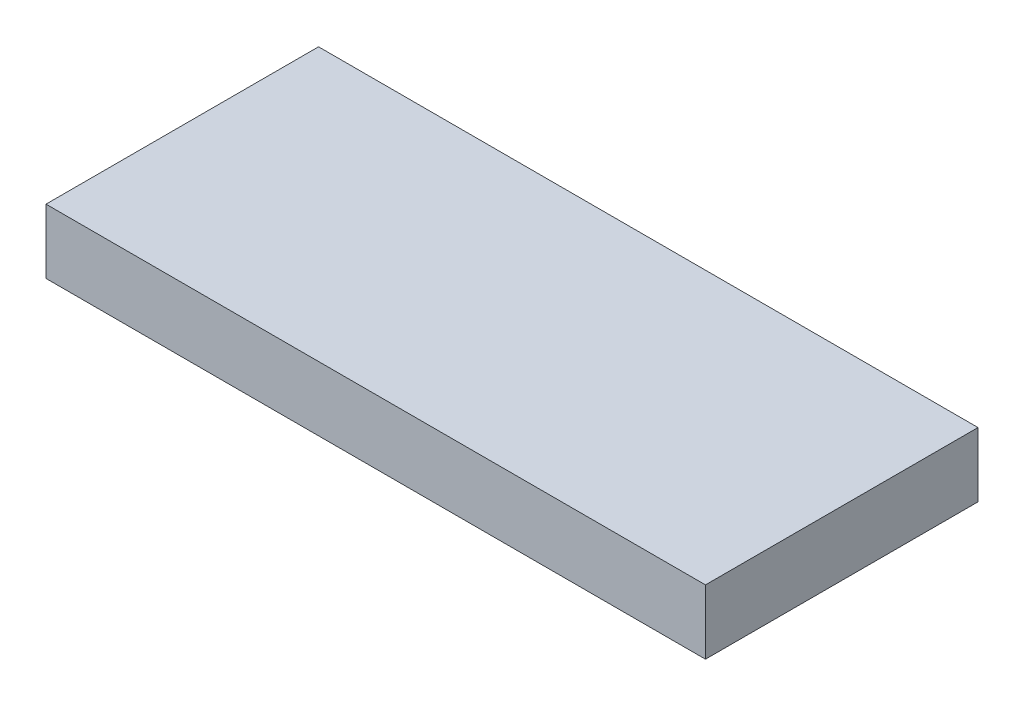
ISO-10303-21;
HEADER;
FILE_DESCRIPTION(('STEP AP214'),'2;1');
FILE_NAME('part.step','',(''),(''),'','','');
FILE_SCHEMA(('AUTOMOTIVE_DESIGN { 1 0 10303 214 1 1 1 1 }'));
ENDSEC;
DATA;
#1=APPLICATION_CONTEXT('core data for automotive mechanical design processes');
#2=APPLICATION_PROTOCOL_DEFINITION('international standard','automotive_design',2000,#1);
#3=PRODUCT_CONTEXT('',#1,'mechanical');
#4=PRODUCT('Part','Part','',(#3));
#5=PRODUCT_RELATED_PRODUCT_CATEGORY('part','',(#4));
#6=PRODUCT_DEFINITION_FORMATION('','',#4);
#7=PRODUCT_DEFINITION_CONTEXT('part definition',#1,'design');
#8=PRODUCT_DEFINITION('design','',#6,#7);
#9=PRODUCT_DEFINITION_SHAPE('','',#8);
#10=(LENGTH_UNIT() NAMED_UNIT(*) SI_UNIT(.MILLI.,.METRE.));
#11=(NAMED_UNIT(*) PLANE_ANGLE_UNIT() SI_UNIT($,.RADIAN.));
#12=(NAMED_UNIT(*) SI_UNIT($,.STERADIAN.) SOLID_ANGLE_UNIT());
#13=UNCERTAINTY_MEASURE_WITH_UNIT(LENGTH_MEASURE(1.E-05),#10,'distance_accuracy_value','');
#14=(GEOMETRIC_REPRESENTATION_CONTEXT(3) GLOBAL_UNCERTAINTY_ASSIGNED_CONTEXT((#13)) GLOBAL_UNIT_ASSIGNED_CONTEXT((#10,
#11,#12)) REPRESENTATION_CONTEXT('',''));
#15=CARTESIAN_POINT('',(0.,0.,0.));
#16=DIRECTION('',(0.,0.,1.));
#17=DIRECTION('',(1.,0.,0.));
#18=AXIS2_PLACEMENT_3D('',#15,#16,#17);
#19=CARTESIAN_POINT('',(-15.365,3.,6.35));
#20=DIRECTION('',(1.,0.,0.));
#21=DIRECTION('',(0.,0.,-1.));
#22=AXIS2_PLACEMENT_3D('',#19,#20,#21);
#23=PLANE('',#22);
#24=DIRECTION('',(0.,0.,1.));
#25=VECTOR('',#24,1.);
#26=CARTESIAN_POINT('',(-15.365,0.,6.35));
#27=LINE('',#26,#25);
#28=CARTESIAN_POINT('',(-15.365,0.,-6.35));
#29=VERTEX_POINT('',#28);
#30=CARTESIAN_POINT('',(-15.365,0.,6.35));
#31=VERTEX_POINT('',#30);
#32=EDGE_CURVE('E108',#29,#31,#27,.T.);
#33=ORIENTED_EDGE('',*,*,#32,.T.);
#34=DIRECTION('',(0.,-1.,0.));
#35=VECTOR('',#34,1.);
#36=CARTESIAN_POINT('',(-15.365,3.,6.35));
#37=LINE('',#36,#35);
#38=CARTESIAN_POINT('',(-15.365,3.,6.35));
#39=VERTEX_POINT('',#38);
#40=EDGE_CURVE('E11',#39,#31,#37,.T.);
#41=ORIENTED_EDGE('',*,*,#40,.F.);
#42=DIRECTION('',(0.,0.,1.));
#43=VECTOR('',#42,1.);
#44=CARTESIAN_POINT('',(-15.365,3.,6.35));
#45=LINE('',#44,#43);
#46=CARTESIAN_POINT('',(-15.365,3.,-6.35));
#47=VERTEX_POINT('',#46);
#48=EDGE_CURVE('E96',#47,#39,#45,.T.);
#49=ORIENTED_EDGE('',*,*,#48,.F.);
#50=DIRECTION('',(0.,-1.,0.));
#51=VECTOR('',#50,1.);
#52=CARTESIAN_POINT('',(-15.365,3.,-6.35));
#53=LINE('',#52,#51);
#54=EDGE_CURVE('E104',#47,#29,#53,.T.);
#55=ORIENTED_EDGE('',*,*,#54,.T.);
#56=EDGE_LOOP('',(#33,#41,#49,#55));
#57=FACE_BOUND('',#56,.T.);
#58=ADVANCED_FACE('F45',(#57),#23,.F.);
#59=CARTESIAN_POINT('',(15.365,3.,6.35));
#60=DIRECTION('',(0.,0.,-1.));
#61=DIRECTION('',(-1.,0.,0.));
#62=AXIS2_PLACEMENT_3D('',#59,#60,#61);
#63=PLANE('',#62);
#64=DIRECTION('',(1.,0.,0.));
#65=VECTOR('',#64,1.);
#66=CARTESIAN_POINT('',(15.365,0.,6.35));
#67=LINE('',#66,#65);
#68=CARTESIAN_POINT('',(15.365,0.,6.35));
#69=VERTEX_POINT('',#68);
#70=EDGE_CURVE('E100',#31,#69,#67,.T.);
#71=ORIENTED_EDGE('',*,*,#70,.T.);
#72=DIRECTION('',(0.,-1.,0.));
#73=VECTOR('',#72,1.);
#74=CARTESIAN_POINT('',(15.365,3.,6.35));
#75=LINE('',#74,#73);
#76=CARTESIAN_POINT('',(15.365,3.,6.35));
#77=VERTEX_POINT('',#76);
#78=EDGE_CURVE('E53',#77,#69,#75,.T.);
#79=ORIENTED_EDGE('',*,*,#78,.F.);
#80=DIRECTION('',(1.,0.,0.));
#81=VECTOR('',#80,1.);
#82=CARTESIAN_POINT('',(15.365,3.,6.35));
#83=LINE('',#82,#81);
#84=EDGE_CURVE('E91',#39,#77,#83,.T.);
#85=ORIENTED_EDGE('',*,*,#84,.F.);
#86=ORIENTED_EDGE('',*,*,#40,.T.);
#87=EDGE_LOOP('',(#71,#79,#85,#86));
#88=FACE_BOUND('',#87,.T.);
#89=ADVANCED_FACE('F99',(#88),#63,.F.);
#90=CARTESIAN_POINT('',(15.365,3.,6.35));
#91=DIRECTION('',(-1.,0.,0.));
#92=DIRECTION('',(0.,0.,1.));
#93=AXIS2_PLACEMENT_3D('',#90,#91,#92);
#94=PLANE('',#93);
#95=DIRECTION('',(0.,0.,-1.));
#96=VECTOR('',#95,1.);
#97=CARTESIAN_POINT('',(15.365,0.,6.35));
#98=LINE('',#97,#96);
#99=CARTESIAN_POINT('',(15.365,0.,-6.35));
#100=VERTEX_POINT('',#99);
#101=EDGE_CURVE('E78',#69,#100,#98,.T.);
#102=ORIENTED_EDGE('',*,*,#101,.T.);
#103=DIRECTION('',(0.,-1.,0.));
#104=VECTOR('',#103,1.);
#105=CARTESIAN_POINT('',(15.365,3.,-6.35));
#106=LINE('',#105,#104);
#107=CARTESIAN_POINT('',(15.365,3.,-6.35));
#108=VERTEX_POINT('',#107);
#109=EDGE_CURVE('E101',#108,#100,#106,.T.);
#110=ORIENTED_EDGE('',*,*,#109,.F.);
#111=DIRECTION('',(0.,0.,-1.));
#112=VECTOR('',#111,1.);
#113=CARTESIAN_POINT('',(15.365,3.,6.35));
#114=LINE('',#113,#112);
#115=EDGE_CURVE('E94',#77,#108,#114,.T.);
#116=ORIENTED_EDGE('',*,*,#115,.F.);
#117=ORIENTED_EDGE('',*,*,#78,.T.);
#118=EDGE_LOOP('',(#102,#110,#116,#117));
#119=FACE_BOUND('',#118,.T.);
#120=ADVANCED_FACE('F102',(#119),#94,.F.);
#121=CARTESIAN_POINT('',(15.365,3.,-6.35));
#122=DIRECTION('',(0.,0.,1.));
#123=DIRECTION('',(1.,0.,0.));
#124=AXIS2_PLACEMENT_3D('',#121,#122,#123);
#125=PLANE('',#124);
#126=DIRECTION('',(-1.,0.,0.));
#127=VECTOR('',#126,1.);
#128=CARTESIAN_POINT('',(15.365,0.,-6.35));
#129=LINE('',#128,#127);
#130=EDGE_CURVE('E84',#100,#29,#129,.T.);
#131=ORIENTED_EDGE('',*,*,#130,.T.);
#132=ORIENTED_EDGE('',*,*,#54,.F.);
#133=DIRECTION('',(-1.,0.,0.));
#134=VECTOR('',#133,1.);
#135=CARTESIAN_POINT('',(15.365,3.,-6.35));
#136=LINE('',#135,#134);
#137=EDGE_CURVE('E61',#108,#47,#136,.T.);
#138=ORIENTED_EDGE('',*,*,#137,.F.);
#139=ORIENTED_EDGE('',*,*,#109,.T.);
#140=EDGE_LOOP('',(#131,#132,#138,#139));
#141=FACE_BOUND('',#140,.T.);
#142=ADVANCED_FACE('F115',(#141),#125,.F.);
#143=CARTESIAN_POINT('',(0.,3.,0.));
#144=DIRECTION('',(0.,1.,0.));
#145=DIRECTION('',(0.,0.,1.));
#146=AXIS2_PLACEMENT_3D('',#143,#144,#145);
#147=PLANE('',#146);
#148=ORIENTED_EDGE('',*,*,#48,.T.);
#149=ORIENTED_EDGE('',*,*,#84,.T.);
#150=ORIENTED_EDGE('',*,*,#115,.T.);
#151=ORIENTED_EDGE('',*,*,#137,.T.);
#152=EDGE_LOOP('',(#148,#149,#150,#151));
#153=FACE_BOUND('',#152,.T.);
#154=ADVANCED_FACE('F92',(#153),#147,.T.);
#155=CARTESIAN_POINT('',(0.,0.,0.));
#156=DIRECTION('',(0.,1.,0.));
#157=DIRECTION('',(0.,0.,1.));
#158=AXIS2_PLACEMENT_3D('',#155,#156,#157);
#159=PLANE('',#158);
#160=ORIENTED_EDGE('',*,*,#32,.F.);
#161=ORIENTED_EDGE('',*,*,#130,.F.);
#162=ORIENTED_EDGE('',*,*,#101,.F.);
#163=ORIENTED_EDGE('',*,*,#70,.F.);
#164=EDGE_LOOP('',(#160,#161,#162,#163));
#165=FACE_BOUND('',#164,.T.);
#166=ADVANCED_FACE('F118',(#165),#159,.F.);
#167=CLOSED_SHELL('',(#58,#89,#120,#142,#154,#166));
#168=MANIFOLD_SOLID_BREP('B2',#167);
#169=ADVANCED_BREP_SHAPE_REPRESENTATION('',(#18,#168),#14);
#170=SHAPE_DEFINITION_REPRESENTATION(#9,#169);
ENDSEC;
END-ISO-10303-21;
